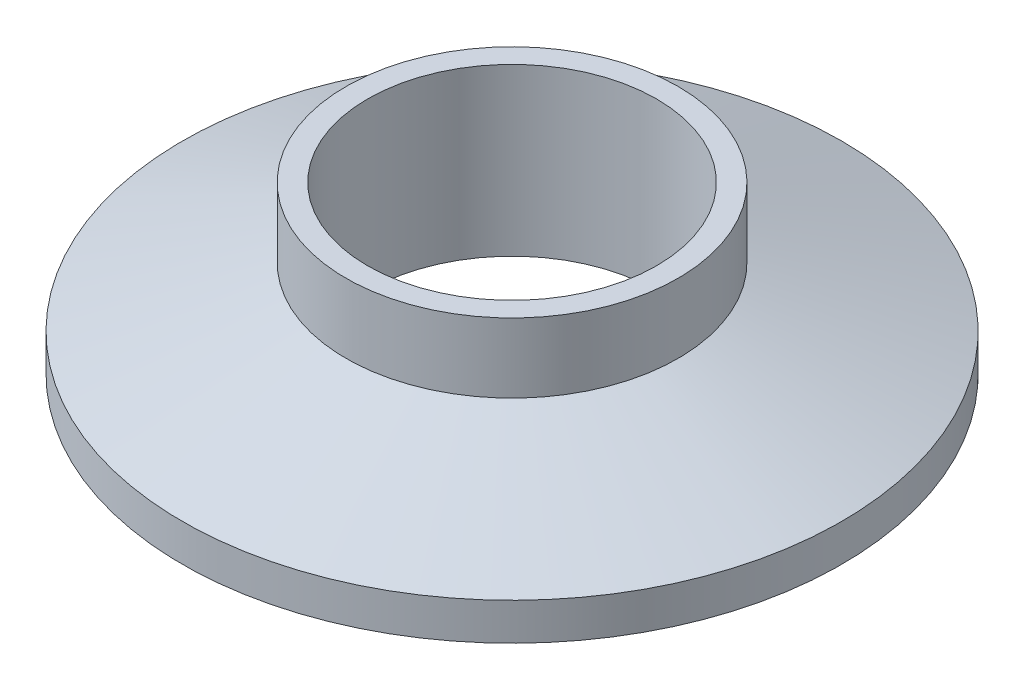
from build123d import *


with BuildPart() as part:
    # Sketch1 → Revolve2 (revolve)
    with BuildSketch(Plane.XY, mode=Mode.PRIVATE) as revolve2_sk:
        with BuildLine():
            Line((-11.049, 0), (-11.049, 12.7))
            Line((-11.049, 12.7), (-12.7, 12.7))
            Line((-12.7, 12.7), (-12.7, 7.393263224))
            Line((-12.7, 7.393263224), (-25.1968, 2.8448))
            Line((-25.1968, 2.8448), (-25.1968, 0))
            Line((-25.1968, 0), (-23.636608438, 0))
            ThreePointArc((-23.636608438, 0), (-23.204411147, 0.129217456), (-22.914066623, 0.474458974))
            ThreePointArc((-22.914066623, 0.474458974), (-21.8186, 1.1938), (-20.723133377, 0.474458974))
            ThreePointArc((-20.723133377, 0.474458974), (-20.432788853, 0.129217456), (-20.000591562, 0))
            Line((-20.000591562, 0), (-11.049, 0))
        make_face()
    revolve(revolve2_sk.sketch.rotate(Axis((0, 0, 0), (0, 1, 0)), 270), axis=Axis((0, 0, 0), (0, 1, 0)))


solid = part.part
